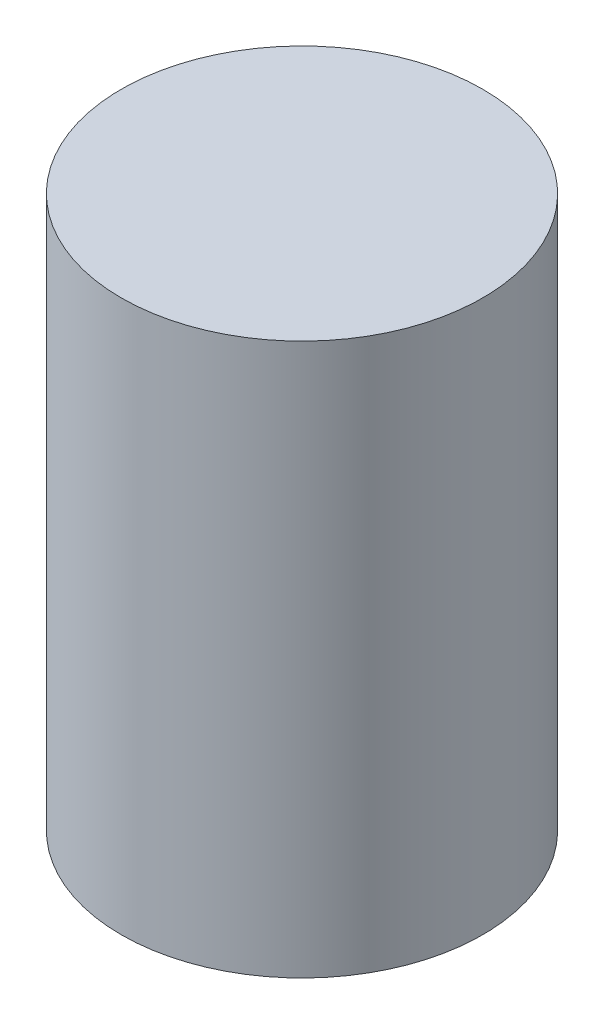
from build123d import *

# Parameters (mm, degrees)
SKETCH1_R           = 22.225
BOSS_EXTRUDE1_DEPTH = 67.818


with BuildPart() as part:
    # Sketch1 → Boss-Extrude1 (new body)
    with BuildSketch(Plane(origin=(0, 0, 0), x_dir=(1, 0, 0), z_dir=(0, 1, 0))):
        with Locations(Location((0, 0, 0), (0, 0, 270))):
            Circle(SKETCH1_R)
    extrude(amount=BOSS_EXTRUDE1_DEPTH)


solid = part.part
